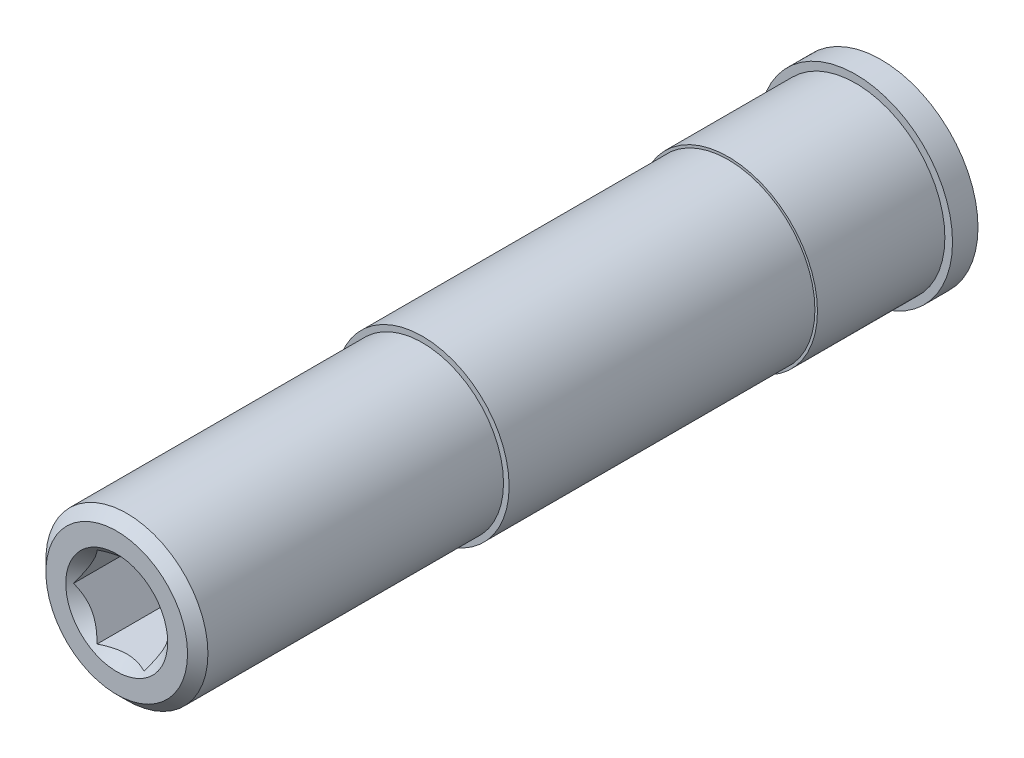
ISO-10303-21;
HEADER;
FILE_DESCRIPTION(('STEP AP214'),'2;1');
FILE_NAME('part.step','',(''),(''),'','','');
FILE_SCHEMA(('AUTOMOTIVE_DESIGN { 1 0 10303 214 1 1 1 1 }'));
ENDSEC;
DATA;
#1=APPLICATION_CONTEXT('core data for automotive mechanical design processes');
#2=APPLICATION_PROTOCOL_DEFINITION('international standard','automotive_design',2000,#1);
#3=PRODUCT_CONTEXT('',#1,'mechanical');
#4=PRODUCT('Part','Part','',(#3));
#5=PRODUCT_RELATED_PRODUCT_CATEGORY('part','',(#4));
#6=PRODUCT_DEFINITION_FORMATION('','',#4);
#7=PRODUCT_DEFINITION_CONTEXT('part definition',#1,'design');
#8=PRODUCT_DEFINITION('design','',#6,#7);
#9=PRODUCT_DEFINITION_SHAPE('','',#8);
#10=(LENGTH_UNIT() NAMED_UNIT(*) SI_UNIT(.MILLI.,.METRE.));
#11=(NAMED_UNIT(*) PLANE_ANGLE_UNIT() SI_UNIT($,.RADIAN.));
#12=(NAMED_UNIT(*) SI_UNIT($,.STERADIAN.) SOLID_ANGLE_UNIT());
#13=UNCERTAINTY_MEASURE_WITH_UNIT(LENGTH_MEASURE(1.E-05),#10,'distance_accuracy_value','');
#14=(GEOMETRIC_REPRESENTATION_CONTEXT(3) GLOBAL_UNCERTAINTY_ASSIGNED_CONTEXT((#13)) GLOBAL_UNIT_ASSIGNED_CONTEXT((#10,
#11,#12)) REPRESENTATION_CONTEXT('',''));
#15=CARTESIAN_POINT('',(0.,0.,0.));
#16=DIRECTION('',(0.,0.,1.));
#17=DIRECTION('',(1.,0.,0.));
#18=AXIS2_PLACEMENT_3D('',#15,#16,#17);
#19=CARTESIAN_POINT('',(0.,0.,45.));
#20=DIRECTION('',(0.,0.,1.));
#21=DIRECTION('',(1.,0.,0.));
#22=AXIS2_PLACEMENT_3D('',#19,#20,#21);
#23=PLANE('',#22);
#24=CARTESIAN_POINT('',(0.,0.,45.));
#25=DIRECTION('',(0.,0.,1.));
#26=DIRECTION('',(1.,0.,0.));
#27=AXIS2_PLACEMENT_3D('',#24,#25,#26);
#28=CIRCLE('',#27,8.5);
#29=CARTESIAN_POINT('',(8.5,0.,45.));
#30=VERTEX_POINT('',#29);
#31=EDGE_CURVE('E134',#30,#30,#28,.T.);
#32=ORIENTED_EDGE('',*,*,#31,.T.);
#33=EDGE_LOOP('',(#32));
#34=FACE_BOUND('',#33,.T.);
#35=CARTESIAN_POINT('',(0.,0.,45.));
#36=DIRECTION('',(0.,0.,1.));
#37=DIRECTION('',(1.,0.,0.));
#38=AXIS2_PLACEMENT_3D('',#35,#36,#37);
#39=CIRCLE('',#38,7.95);
#40=CARTESIAN_POINT('',(7.95,0.,45.));
#41=VERTEX_POINT('',#40);
#42=EDGE_CURVE('E120',#41,#41,#39,.T.);
#43=ORIENTED_EDGE('',*,*,#42,.F.);
#44=EDGE_LOOP('',(#43));
#45=FACE_BOUND('',#44,.T.);
#46=ADVANCED_FACE('F32',(#34,#45),#23,.T.);
#47=CARTESIAN_POINT('',(0.,0.,15.));
#48=DIRECTION('',(0.,0.,1.));
#49=DIRECTION('',(1.,0.,0.));
#50=AXIS2_PLACEMENT_3D('',#47,#48,#49);
#51=PLANE('',#50);
#52=CARTESIAN_POINT('',(0.,0.,15.));
#53=DIRECTION('',(0.,0.,1.));
#54=DIRECTION('',(1.,0.,0.));
#55=AXIS2_PLACEMENT_3D('',#52,#53,#54);
#56=CIRCLE('',#55,8.75);
#57=CARTESIAN_POINT('',(8.75,0.,15.));
#58=VERTEX_POINT('',#57);
#59=EDGE_CURVE('E140',#58,#58,#56,.T.);
#60=ORIENTED_EDGE('',*,*,#59,.T.);
#61=EDGE_LOOP('',(#60));
#62=FACE_BOUND('',#61,.T.);
#63=CARTESIAN_POINT('',(0.,0.,15.));
#64=DIRECTION('',(0.,0.,1.));
#65=DIRECTION('',(1.,0.,0.));
#66=AXIS2_PLACEMENT_3D('',#63,#64,#65);
#67=CIRCLE('',#66,8.5);
#68=CARTESIAN_POINT('',(8.5,0.,15.));
#69=VERTEX_POINT('',#68);
#70=EDGE_CURVE('E133',#69,#69,#67,.T.);
#71=ORIENTED_EDGE('',*,*,#70,.F.);
#72=EDGE_LOOP('',(#71));
#73=FACE_BOUND('',#72,.T.);
#74=ADVANCED_FACE('F213',(#62,#73),#51,.T.);
#75=CARTESIAN_POINT('',(0.,0.,2.5));
#76=DIRECTION('',(0.,0.,1.));
#77=DIRECTION('',(1.,0.,0.));
#78=AXIS2_PLACEMENT_3D('',#75,#76,#77);
#79=PLANE('',#78);
#80=CARTESIAN_POINT('',(0.,0.,2.5));
#81=DIRECTION('',(0.,0.,1.));
#82=DIRECTION('',(1.,0.,0.));
#83=AXIS2_PLACEMENT_3D('',#80,#81,#82);
#84=CIRCLE('',#83,9.5);
#85=CARTESIAN_POINT('',(9.5,0.,2.5));
#86=VERTEX_POINT('',#85);
#87=EDGE_CURVE('E146',#86,#86,#84,.T.);
#88=ORIENTED_EDGE('',*,*,#87,.T.);
#89=EDGE_LOOP('',(#88));
#90=FACE_BOUND('',#89,.T.);
#91=CARTESIAN_POINT('',(0.,0.,2.5));
#92=DIRECTION('',(0.,0.,1.));
#93=DIRECTION('',(1.,0.,0.));
#94=AXIS2_PLACEMENT_3D('',#91,#92,#93);
#95=CIRCLE('',#94,8.75);
#96=CARTESIAN_POINT('',(8.75,0.,2.5));
#97=VERTEX_POINT('',#96);
#98=EDGE_CURVE('E137',#97,#97,#95,.T.);
#99=ORIENTED_EDGE('',*,*,#98,.F.);
#100=EDGE_LOOP('',(#99));
#101=FACE_BOUND('',#100,.T.);
#102=ADVANCED_FACE('F219',(#90,#101),#79,.T.);
#103=CARTESIAN_POINT('',(0.,0.,2.5));
#104=DIRECTION('',(0.,0.,-1.));
#105=DIRECTION('',(-1.,0.,0.));
#106=AXIS2_PLACEMENT_3D('',#103,#104,#105);
#107=CYLINDRICAL_SURFACE('',#106,9.5);
#108=ORIENTED_EDGE('',*,*,#87,.F.);
#109=EDGE_LOOP('',(#108));
#110=FACE_BOUND('',#109,.T.);
#111=CARTESIAN_POINT('',(0.,0.,0.));
#112=DIRECTION('',(0.,0.,1.));
#113=DIRECTION('',(1.,0.,0.));
#114=AXIS2_PLACEMENT_3D('',#111,#112,#113);
#115=CIRCLE('',#114,9.5);
#116=CARTESIAN_POINT('',(9.5,0.,0.));
#117=VERTEX_POINT('',#116);
#118=EDGE_CURVE('E143',#117,#117,#115,.T.);
#119=ORIENTED_EDGE('',*,*,#118,.T.);
#120=EDGE_LOOP('',(#119));
#121=FACE_BOUND('',#120,.T.);
#122=ADVANCED_FACE('F236',(#110,#121),#107,.T.);
#123=CARTESIAN_POINT('',(0.,0.,0.));
#124=DIRECTION('',(0.,0.,1.));
#125=DIRECTION('',(1.,0.,0.));
#126=AXIS2_PLACEMENT_3D('',#123,#124,#125);
#127=PLANE('',#126);
#128=ORIENTED_EDGE('',*,*,#118,.F.);
#129=EDGE_LOOP('',(#128));
#130=FACE_BOUND('',#129,.T.);
#131=ADVANCED_FACE('F232',(#130),#127,.F.);
#132=CARTESIAN_POINT('',(0.,0.,15.));
#133=DIRECTION('',(0.,0.,-1.));
#134=DIRECTION('',(-1.,0.,0.));
#135=AXIS2_PLACEMENT_3D('',#132,#133,#134);
#136=CYLINDRICAL_SURFACE('',#135,8.75);
#137=ORIENTED_EDGE('',*,*,#59,.F.);
#138=EDGE_LOOP('',(#137));
#139=FACE_BOUND('',#138,.T.);
#140=ORIENTED_EDGE('',*,*,#98,.T.);
#141=EDGE_LOOP('',(#140));
#142=FACE_BOUND('',#141,.T.);
#143=ADVANCED_FACE('F227',(#139,#142),#136,.T.);
#144=CARTESIAN_POINT('',(0.,0.,45.));
#145=DIRECTION('',(0.,0.,-1.));
#146=DIRECTION('',(-1.,0.,0.));
#147=AXIS2_PLACEMENT_3D('',#144,#145,#146);
#148=CYLINDRICAL_SURFACE('',#147,8.5);
#149=ORIENTED_EDGE('',*,*,#31,.F.);
#150=EDGE_LOOP('',(#149));
#151=FACE_BOUND('',#150,.T.);
#152=ORIENTED_EDGE('',*,*,#70,.T.);
#153=EDGE_LOOP('',(#152));
#154=FACE_BOUND('',#153,.T.);
#155=ADVANCED_FACE('F225',(#151,#154),#148,.T.);
#156=CARTESIAN_POINT('',(0.,0.,75.));
#157=DIRECTION('',(0.,0.,-1.));
#158=DIRECTION('',(-1.,0.,0.));
#159=AXIS2_PLACEMENT_3D('',#156,#157,#158);
#160=CYLINDRICAL_SURFACE('',#159,7.95);
#161=CARTESIAN_POINT('',(0.,0.,74.));
#162=DIRECTION('',(0.,0.,1.));
#163=DIRECTION('',(1.,0.,0.));
#164=AXIS2_PLACEMENT_3D('',#161,#162,#163);
#165=CIRCLE('',#164,7.95);
#166=CARTESIAN_POINT('',(7.95,0.,74.));
#167=VERTEX_POINT('',#166);
#168=EDGE_CURVE('E154',#167,#167,#165,.F.);
#169=ORIENTED_EDGE('',*,*,#168,.T.);
#170=EDGE_LOOP('',(#169));
#171=FACE_BOUND('',#170,.T.);
#172=ORIENTED_EDGE('',*,*,#42,.T.);
#173=EDGE_LOOP('',(#172));
#174=FACE_BOUND('',#173,.T.);
#175=ADVANCED_FACE('F224',(#171,#174),#160,.T.);
#176=CARTESIAN_POINT('',(0.,0.,75.));
#177=DIRECTION('',(0.,0.,1.));
#178=DIRECTION('',(1.,0.,0.));
#179=AXIS2_PLACEMENT_3D('',#176,#177,#178);
#180=PLANE('',#179);
#181=CARTESIAN_POINT('',(0.,0.,75.));
#182=DIRECTION('',(0.,0.,1.));
#183=DIRECTION('',(1.,0.,0.));
#184=AXIS2_PLACEMENT_3D('',#181,#182,#183);
#185=CIRCLE('',#184,5.);
#186=CARTESIAN_POINT('',(5.,0.,75.));
#187=VERTEX_POINT('',#186);
#188=EDGE_CURVE('E157',#187,#187,#185,.F.);
#189=ORIENTED_EDGE('',*,*,#188,.T.);
#190=EDGE_LOOP('',(#189));
#191=FACE_BOUND('',#190,.T.);
#192=CARTESIAN_POINT('',(0.,0.,75.));
#193=DIRECTION('',(0.,0.,1.));
#194=DIRECTION('',(1.,0.,0.));
#195=AXIS2_PLACEMENT_3D('',#192,#193,#194);
#196=CIRCLE('',#195,6.95);
#197=CARTESIAN_POINT('',(6.95,0.,75.));
#198=VERTEX_POINT('',#197);
#199=EDGE_CURVE('E149',#198,#198,#196,.T.);
#200=ORIENTED_EDGE('',*,*,#199,.T.);
#201=EDGE_LOOP('',(#200));
#202=FACE_BOUND('',#201,.T.);
#203=ADVANCED_FACE('F182',(#191,#202),#180,.T.);
#204=CARTESIAN_POINT('',(0.,0.,75.));
#205=DIRECTION('',(0.,0.,-1.));
#206=DIRECTION('',(-1.,0.,0.));
#207=AXIS2_PLACEMENT_3D('',#204,#205,#206);
#208=CONICAL_SURFACE('',#207,6.95,0.785398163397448);
#209=ORIENTED_EDGE('',*,*,#168,.F.);
#210=EDGE_LOOP('',(#209));
#211=FACE_BOUND('',#210,.T.);
#212=ORIENTED_EDGE('',*,*,#199,.F.);
#213=EDGE_LOOP('',(#212));
#214=FACE_BOUND('',#213,.T.);
#215=ADVANCED_FACE('F243',(#211,#214),#208,.T.);
#216=CARTESIAN_POINT('',(0.,0.,74.));
#217=DIRECTION('',(0.,0.,1.));
#218=DIRECTION('',(1.,0.,0.));
#219=AXIS2_PLACEMENT_3D('',#216,#217,#218);
#220=CONICAL_SURFACE('',#219,4.,0.785398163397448);
#221=CARTESIAN_POINT('',(-4.61891762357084,0.000200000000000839,74.6189176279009));
#222=CARTESIAN_POINT('',(-4.57920690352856,-0.0685809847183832,74.5792110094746));
#223=CARTESIAN_POINT('',(-4.53919230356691,-0.137888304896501,74.5407225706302));
#224=CARTESIAN_POINT('',(-4.45849274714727,-0.277664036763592,74.4665533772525));
#225=CARTESIAN_POINT('',(-4.41780743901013,-0.348133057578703,74.4308741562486));
#226=CARTESIAN_POINT('',(-4.29427352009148,-0.562100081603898,74.328303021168));
#227=CARTESIAN_POINT('',(-4.21037499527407,-0.707416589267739,74.2663152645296));
#228=CARTESIAN_POINT('',(-4.04121970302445,-1.00040214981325,74.1601580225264));
#229=CARTESIAN_POINT('',(-3.95600566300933,-1.14799719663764,74.1157212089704));
#230=CARTESIAN_POINT('',(-3.78369592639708,-1.44644641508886,74.0472511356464));
#231=CARTESIAN_POINT('',(-3.6966055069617,-1.59729144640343,74.0231667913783));
#232=CARTESIAN_POINT('',(-3.54650860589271,-1.85726690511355,74.0014370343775));
#233=CARTESIAN_POINT('',(-3.48369550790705,-1.96606238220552,73.9982210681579));
#234=CARTESIAN_POINT('',(-3.35817126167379,-2.18347675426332,74.003642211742));
#235=CARTESIAN_POINT('',(-3.29546015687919,-2.29209557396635,74.0122834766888));
#236=CARTESIAN_POINT('',(-3.17063214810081,-2.50830402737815,74.0409261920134));
#237=CARTESIAN_POINT('',(-3.10851598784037,-2.61589237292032,74.0609403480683));
#238=CARTESIAN_POINT('',(-2.98535047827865,-2.82922129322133,74.1112363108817));
#239=CARTESIAN_POINT('',(-2.92430104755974,-2.93496200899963,74.1415173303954));
#240=CARTESIAN_POINT('',(-2.81592361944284,-3.12267722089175,74.2038174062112));
#241=CARTESIAN_POINT('',(-2.76835567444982,-3.2050673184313,74.2341984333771));
#242=CARTESIAN_POINT('',(-2.67407371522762,-3.36836846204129,74.2998566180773));
#243=CARTESIAN_POINT('',(-2.6273597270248,-3.44927946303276,74.3351339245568));
#244=CARTESIAN_POINT('',(-2.53493285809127,-3.60936749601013,74.4097938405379));
#245=CARTESIAN_POINT('',(-2.48921734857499,-3.68854908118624,74.4491635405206));
#246=CARTESIAN_POINT('',(-2.39863292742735,-3.84544590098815,74.5314912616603));
#247=CARTESIAN_POINT('',(-2.35376351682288,-3.92316199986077,74.574447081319));
#248=CARTESIAN_POINT('',(-2.30928560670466,-4.0002,74.6189176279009));
#249=B_SPLINE_CURVE_WITH_KNOTS('',3,(#221,#222,#223,#224,#225,#226,#227,#228,#229,#230,#231,
#232,#233,#234,#235,#236,#237,#238,#239,#240,#241,#242,#243,#244,#245,#246,#247,#248),
.UNSPECIFIED.,.F.,.F.,(4,2,2,2,2,2,2,2,2,2,2,2,2,4),(0.,0.266361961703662,0.532868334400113,
1.06875865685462,1.5961388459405,2.12219135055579,2.49866160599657,2.87526382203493,
3.25228760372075,3.62928248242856,3.9287494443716,4.22822551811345,4.52678401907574,
4.82516056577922),.UNSPECIFIED.);
#250=CARTESIAN_POINT('',(-4.618802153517,0.,74.618802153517));
#251=VERTEX_POINT('',#250);
#252=CARTESIAN_POINT('',(-2.3094010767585,-4.,74.618802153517));
#253=VERTEX_POINT('',#252);
#254=EDGE_CURVE('E11',#251,#253,#249,.T.);
#255=ORIENTED_EDGE('',*,*,#254,.F.);
#256=CARTESIAN_POINT('',(-2.30928560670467,4.0002,74.6189176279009));
#257=CARTESIAN_POINT('',(-2.34899632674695,3.93141901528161,74.5792110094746));
#258=CARTESIAN_POINT('',(-2.3890109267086,3.8621116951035,74.5407225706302));
#259=CARTESIAN_POINT('',(-2.46971048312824,3.7223359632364,74.4665533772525));
#260=CARTESIAN_POINT('',(-2.51039579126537,3.65186694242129,74.4308741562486));
#261=CARTESIAN_POINT('',(-2.63392971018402,3.4378999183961,74.328303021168));
#262=CARTESIAN_POINT('',(-2.71782823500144,3.29258341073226,74.2663152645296));
#263=CARTESIAN_POINT('',(-2.88698352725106,2.99959785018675,74.1601580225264));
#264=CARTESIAN_POINT('',(-2.97219756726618,2.85200280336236,74.1157212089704));
#265=CARTESIAN_POINT('',(-3.14450730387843,2.55355358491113,74.0472511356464));
#266=CARTESIAN_POINT('',(-3.23159772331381,2.40270855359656,74.0231667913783));
#267=CARTESIAN_POINT('',(-3.3816946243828,2.14273309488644,74.0014370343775));
#268=CARTESIAN_POINT('',(-3.44450772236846,2.03393761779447,73.9982210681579));
#269=CARTESIAN_POINT('',(-3.57003196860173,1.81652324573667,74.003642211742));
#270=CARTESIAN_POINT('',(-3.63274307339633,1.70790442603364,74.0122834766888));
#271=CARTESIAN_POINT('',(-3.7575710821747,1.49169597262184,74.0409261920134));
#272=CARTESIAN_POINT('',(-3.81968724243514,1.38410762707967,74.0609403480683));
#273=CARTESIAN_POINT('',(-3.94285275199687,1.17077870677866,74.1112363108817));
#274=CARTESIAN_POINT('',(-4.00390218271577,1.06503799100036,74.1415173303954));
#275=CARTESIAN_POINT('',(-4.11227961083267,0.877322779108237,74.2038174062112));
#276=CARTESIAN_POINT('',(-4.15984755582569,0.794932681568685,74.2341984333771));
#277=CARTESIAN_POINT('',(-4.25412951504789,0.631631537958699,74.2998566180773));
#278=CARTESIAN_POINT('',(-4.30084350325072,0.550720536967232,74.3351339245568));
#279=CARTESIAN_POINT('',(-4.39327037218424,0.390632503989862,74.4097938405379));
#280=CARTESIAN_POINT('',(-4.43898588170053,0.311450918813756,74.4491635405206));
#281=CARTESIAN_POINT('',(-4.52957030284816,0.154554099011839,74.5314912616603));
#282=CARTESIAN_POINT('',(-4.57443971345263,0.0768380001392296,74.574447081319));
#283=CARTESIAN_POINT('',(-4.61891762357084,-0.000200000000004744,74.6189176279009));
#284=B_SPLINE_CURVE_WITH_KNOTS('',3,(#256,#257,#258,#259,#260,#261,#262,#263,#264,#265,#266,
#267,#268,#269,#270,#271,#272,#273,#274,#275,#276,#277,#278,#279,#280,#281,#282,#283),
.UNSPECIFIED.,.F.,.F.,(4,2,2,2,2,2,2,2,2,2,2,2,2,4),(0.,0.266361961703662,0.532868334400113,
1.06875865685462,1.5961388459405,2.1221913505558,2.49866160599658,2.87526382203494,
3.25228760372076,3.62928248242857,3.92874944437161,4.22822551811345,4.52678401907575,
4.82516056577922),.UNSPECIFIED.);
#285=CARTESIAN_POINT('',(-2.3094010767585,4.,74.618802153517));
#286=VERTEX_POINT('',#285);
#287=EDGE_CURVE('E188',#286,#251,#284,.T.);
#288=ORIENTED_EDGE('',*,*,#287,.F.);
#289=CARTESIAN_POINT('',(-5.62739378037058,4.,76.9041698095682));
#290=CARTESIAN_POINT('',(-5.48567305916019,4.,76.7886867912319));
#291=CARTESIAN_POINT('',(-5.34325635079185,4.,76.6740442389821));
#292=CARTESIAN_POINT('',(-5.05668167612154,4.,76.4468822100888));
#293=CARTESIAN_POINT('',(-4.91252327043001,4.,76.3343632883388));
#294=CARTESIAN_POINT('',(-4.62060451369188,4.,76.1107371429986));
#295=CARTESIAN_POINT('',(-4.47282202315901,4.,75.9996587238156));
#296=CARTESIAN_POINT('',(-4.17478915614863,4.,75.780883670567));
#297=CARTESIAN_POINT('',(-4.02453901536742,4.,75.6731867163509));
#298=CARTESIAN_POINT('',(-3.70745510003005,4.,75.4526226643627));
#299=CARTESIAN_POINT('',(-3.54034108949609,4.,75.3401561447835));
#300=CARTESIAN_POINT('',(-3.20168901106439,4.,75.1219167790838));
#301=CARTESIAN_POINT('',(-3.03014957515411,4.,75.0161460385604));
#302=CARTESIAN_POINT('',(-2.68253937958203,4.,74.8141548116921));
#303=CARTESIAN_POINT('',(-2.50649297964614,4.,74.7178927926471));
#304=CARTESIAN_POINT('',(-2.14824323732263,4.,74.5377308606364));
#305=CARTESIAN_POINT('',(-1.9660452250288,4.,74.453820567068));
#306=CARTESIAN_POINT('',(-1.64622345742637,4.,74.3237785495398));
#307=CARTESIAN_POINT('',(-1.51024779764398,4.,74.2736228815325));
#308=CARTESIAN_POINT('',(-1.23468247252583,4.,74.1841925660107));
#309=CARTESIAN_POINT('',(-1.09509231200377,4.,74.1449194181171));
#310=CARTESIAN_POINT('',(-0.815895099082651,4.,74.0801558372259));
#311=CARTESIAN_POINT('',(-0.676354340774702,4.,74.0543844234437));
#312=CARTESIAN_POINT('',(-0.395369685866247,4.,74.0170833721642));
#313=CARTESIAN_POINT('',(-0.253926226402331,4.,74.0055505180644));
#314=CARTESIAN_POINT('',(0.0224344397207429,4.,73.9977950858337));
#315=CARTESIAN_POINT('',(0.157331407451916,4.,74.0008491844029));
#316=CARTESIAN_POINT('',(0.426139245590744,4.,74.0203999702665));
#317=CARTESIAN_POINT('',(0.560050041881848,4.,74.0368976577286));
#318=CARTESIAN_POINT('',(0.828249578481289,4.,74.0826693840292));
#319=CARTESIAN_POINT('',(0.962497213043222,4.,74.1121800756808));
#320=CARTESIAN_POINT('',(1.22800919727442,4.,74.1822950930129));
#321=CARTESIAN_POINT('',(1.35927363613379,4.,74.2228990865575));
#322=CARTESIAN_POINT('',(1.62314822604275,4.,74.3149472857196));
#323=CARTESIAN_POINT('',(1.75564045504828,4.,74.3667254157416));
#324=CARTESIAN_POINT('',(2.01721504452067,4.,74.4782979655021));
#325=CARTESIAN_POINT('',(2.14629632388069,4.,74.5380948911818));
#326=CARTESIAN_POINT('',(2.40167335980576,4.,74.6642976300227));
#327=CARTESIAN_POINT('',(2.52795890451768,4.,74.7307239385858));
#328=CARTESIAN_POINT('',(2.77764203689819,4.,74.8687240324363));
#329=CARTESIAN_POINT('',(2.90104005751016,4.,74.9402970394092));
#330=CARTESIAN_POINT('',(3.1392795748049,4.,75.0839454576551));
#331=CARTESIAN_POINT('',(3.25424234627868,4.,75.1558208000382));
#332=CARTESIAN_POINT('',(3.48219257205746,4.,75.3026473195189));
#333=CARTESIAN_POINT('',(3.59517987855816,4.,75.377598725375));
#334=CARTESIAN_POINT('',(3.81853437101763,4.,75.5294246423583));
#335=CARTESIAN_POINT('',(3.92891526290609,4.,75.6062790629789));
#336=CARTESIAN_POINT('',(4.14816043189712,4.,75.7620608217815));
#337=CARTESIAN_POINT('',(4.25702511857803,4.,75.8409875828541));
#338=CARTESIAN_POINT('',(4.3652532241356,4.,75.9207631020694));
#339=B_SPLINE_CURVE_WITH_KNOTS('',3,(#289,#290,#291,#292,#293,#294,#295,#296,#297,#298,#299,
#300,#301,#302,#303,#304,#305,#306,#307,#308,#309,#310,#311,#312,#313,#314,#315,#316,#317,#318,
#319,#320,#321,#322,#323,#324,#325,#326,#327,#328,#329,#330,#331,#332,#333,#334,#335,#336,#337,
#338),.UNSPECIFIED.,.F.,.F.,(4,2,2,2,2,2,2,2,2,2,2,2,2,2,2,2,2,2,2,2,2,2,2,2,4),(0.,
0.548452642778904,1.0970466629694,1.6516272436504,2.20615515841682,2.8103379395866,
3.41470978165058,4.01631281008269,4.61740731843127,5.05183569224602,5.48632390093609,
5.91136971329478,6.33631948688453,6.74042244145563,7.14455546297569,7.5563622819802,
7.9681567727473,8.39458384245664,8.82114448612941,9.24906733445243,9.67692560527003,
10.0836145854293,10.4903338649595,10.8938112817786,11.2971775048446),.UNSPECIFIED.);
#340=CARTESIAN_POINT('',(2.3094010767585,4.,74.618802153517));
#341=VERTEX_POINT('',#340);
#342=EDGE_CURVE('E166',#341,#286,#339,.F.);
#343=ORIENTED_EDGE('',*,*,#342,.F.);
#344=CARTESIAN_POINT('',(4.61891762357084,-0.000200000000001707,74.6189176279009));
#345=CARTESIAN_POINT('',(4.57920690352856,0.0685809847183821,74.5792110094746));
#346=CARTESIAN_POINT('',(4.53919230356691,0.1378883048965,74.5407225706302));
#347=CARTESIAN_POINT('',(4.45849274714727,0.277664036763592,74.4665533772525));
#348=CARTESIAN_POINT('',(4.41780743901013,0.348133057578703,74.4308741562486));
#349=CARTESIAN_POINT('',(4.29427352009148,0.562100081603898,74.328303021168));
#350=CARTESIAN_POINT('',(4.21037499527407,0.70741658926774,74.2663152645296));
#351=CARTESIAN_POINT('',(4.04121970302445,1.00040214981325,74.1601580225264));
#352=CARTESIAN_POINT('',(3.95600566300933,1.14799719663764,74.1157212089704));
#353=CARTESIAN_POINT('',(3.78369592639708,1.44644641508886,74.0472511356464));
#354=CARTESIAN_POINT('',(3.6966055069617,1.59729144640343,74.0231667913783));
#355=CARTESIAN_POINT('',(3.54650860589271,1.85726690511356,74.0014370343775));
#356=CARTESIAN_POINT('',(3.48369550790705,1.96606238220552,73.9982210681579));
#357=CARTESIAN_POINT('',(3.35817126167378,2.18347675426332,74.003642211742));
#358=CARTESIAN_POINT('',(3.29546015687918,2.29209557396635,74.0122834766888));
#359=CARTESIAN_POINT('',(3.17063214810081,2.50830402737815,74.0409261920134));
#360=CARTESIAN_POINT('',(3.10851598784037,2.61589237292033,74.0609403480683));
#361=CARTESIAN_POINT('',(2.98535047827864,2.82922129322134,74.1112363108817));
#362=CARTESIAN_POINT('',(2.92430104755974,2.93496200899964,74.1415173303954));
#363=CARTESIAN_POINT('',(2.81592361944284,3.12267722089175,74.2038174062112));
#364=CARTESIAN_POINT('',(2.76835567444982,3.2050673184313,74.2341984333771));
#365=CARTESIAN_POINT('',(2.67407371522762,3.36836846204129,74.2998566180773));
#366=CARTESIAN_POINT('',(2.62735972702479,3.44927946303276,74.3351339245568));
#367=CARTESIAN_POINT('',(2.53493285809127,3.60936749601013,74.4097938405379));
#368=CARTESIAN_POINT('',(2.48921734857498,3.68854908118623,74.4491635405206));
#369=CARTESIAN_POINT('',(2.39863292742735,3.84544590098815,74.5314912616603));
#370=CARTESIAN_POINT('',(2.35376351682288,3.92316199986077,74.574447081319));
#371=CARTESIAN_POINT('',(2.30928560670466,4.0002,74.6189176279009));
#372=B_SPLINE_CURVE_WITH_KNOTS('',3,(#344,#345,#346,#347,#348,#349,#350,#351,#352,#353,#354,
#355,#356,#357,#358,#359,#360,#361,#362,#363,#364,#365,#366,#367,#368,#369,#370,#371),
.UNSPECIFIED.,.F.,.F.,(4,2,2,2,2,2,2,2,2,2,2,2,2,4),(0.,0.266361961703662,0.532868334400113,
1.06875865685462,1.5961388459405,2.1221913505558,2.49866160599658,2.87526382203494,
3.25228760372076,3.62928248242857,3.9287494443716,4.22822551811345,4.52678401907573,
4.82516056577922),.UNSPECIFIED.);
#373=CARTESIAN_POINT('',(4.618802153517,0.,74.618802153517));
#374=VERTEX_POINT('',#373);
#375=EDGE_CURVE('E160',#374,#341,#372,.T.);
#376=ORIENTED_EDGE('',*,*,#375,.F.);
#377=CARTESIAN_POINT('',(2.30928560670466,-4.0002,74.6189176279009));
#378=CARTESIAN_POINT('',(2.34899632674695,-3.93141901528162,74.5792110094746));
#379=CARTESIAN_POINT('',(2.3890109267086,-3.8621116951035,74.5407225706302));
#380=CARTESIAN_POINT('',(2.46971048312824,-3.72233596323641,74.4665533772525));
#381=CARTESIAN_POINT('',(2.51039579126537,-3.6518669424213,74.4308741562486));
#382=CARTESIAN_POINT('',(2.63392971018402,-3.4378999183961,74.328303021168));
#383=CARTESIAN_POINT('',(2.71782823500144,-3.29258341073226,74.2663152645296));
#384=CARTESIAN_POINT('',(2.88698352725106,-2.99959785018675,74.1601580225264));
#385=CARTESIAN_POINT('',(2.97219756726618,-2.85200280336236,74.1157212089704));
#386=CARTESIAN_POINT('',(3.14450730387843,-2.55355358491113,74.0472511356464));
#387=CARTESIAN_POINT('',(3.23159772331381,-2.40270855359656,74.0231667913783));
#388=CARTESIAN_POINT('',(3.3816946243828,-2.14273309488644,74.0014370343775));
#389=CARTESIAN_POINT('',(3.44450772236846,-2.03393761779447,73.9982210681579));
#390=CARTESIAN_POINT('',(3.57003196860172,-1.81652324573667,74.003642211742));
#391=CARTESIAN_POINT('',(3.63274307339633,-1.70790442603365,74.0122834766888));
#392=CARTESIAN_POINT('',(3.7575710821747,-1.49169597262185,74.0409261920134));
#393=CARTESIAN_POINT('',(3.81968724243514,-1.38410762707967,74.0609403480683));
#394=CARTESIAN_POINT('',(3.94285275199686,-1.17077870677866,74.1112363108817));
#395=CARTESIAN_POINT('',(4.00390218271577,-1.06503799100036,74.1415173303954));
#396=CARTESIAN_POINT('',(4.11227961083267,-0.877322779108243,74.2038174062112));
#397=CARTESIAN_POINT('',(4.15984755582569,-0.794932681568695,74.2341984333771));
#398=CARTESIAN_POINT('',(4.25412951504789,-0.63163153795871,74.2998566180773));
#399=CARTESIAN_POINT('',(4.30084350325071,-0.550720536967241,74.3351339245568));
#400=CARTESIAN_POINT('',(4.39327037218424,-0.390632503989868,74.4097938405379));
#401=CARTESIAN_POINT('',(4.43898588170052,-0.311450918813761,74.4491635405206));
#402=CARTESIAN_POINT('',(4.52957030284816,-0.15455409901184,74.5314912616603));
#403=CARTESIAN_POINT('',(4.57443971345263,-0.0768380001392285,74.5744470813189));
#404=CARTESIAN_POINT('',(4.61891762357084,0.000200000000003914,74.6189176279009));
#405=B_SPLINE_CURVE_WITH_KNOTS('',3,(#377,#378,#379,#380,#381,#382,#383,#384,#385,#386,#387,
#388,#389,#390,#391,#392,#393,#394,#395,#396,#397,#398,#399,#400,#401,#402,#403,#404),
.UNSPECIFIED.,.F.,.F.,(4,2,2,2,2,2,2,2,2,2,2,2,2,4),(0.,0.266361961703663,0.532868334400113,
1.06875865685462,1.59613884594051,2.1221913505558,2.49866160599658,2.87526382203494,
3.25228760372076,3.62928248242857,3.9287494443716,4.22822551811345,4.52678401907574,
4.82516056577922),.UNSPECIFIED.);
#406=CARTESIAN_POINT('',(2.3094010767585,-4.,74.618802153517));
#407=VERTEX_POINT('',#406);
#408=EDGE_CURVE('E52',#407,#374,#405,.T.);
#409=ORIENTED_EDGE('',*,*,#408,.F.);
#410=CARTESIAN_POINT('',(-5.62739378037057,-4.,76.9041698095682));
#411=CARTESIAN_POINT('',(-5.48567305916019,-4.,76.7886867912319));
#412=CARTESIAN_POINT('',(-5.34325635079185,-4.,76.6740442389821));
#413=CARTESIAN_POINT('',(-5.05668167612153,-4.,76.4468822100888));
#414=CARTESIAN_POINT('',(-4.91252327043,-4.,76.3343632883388));
#415=CARTESIAN_POINT('',(-4.62060451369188,-4.,76.1107371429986));
#416=CARTESIAN_POINT('',(-4.47282202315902,-4.,75.9996587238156));
#417=CARTESIAN_POINT('',(-4.17478915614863,-4.,75.780883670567));
#418=CARTESIAN_POINT('',(-4.02453901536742,-4.,75.6731867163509));
#419=CARTESIAN_POINT('',(-3.70745510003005,-4.,75.4526226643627));
#420=CARTESIAN_POINT('',(-3.5403410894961,-4.,75.3401561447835));
#421=CARTESIAN_POINT('',(-3.2016890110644,-4.,75.1219167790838));
#422=CARTESIAN_POINT('',(-3.03014957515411,-4.,75.0161460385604));
#423=CARTESIAN_POINT('',(-2.68253937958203,-4.,74.8141548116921));
#424=CARTESIAN_POINT('',(-2.50649297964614,-4.,74.7178927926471));
#425=CARTESIAN_POINT('',(-2.14824323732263,-4.,74.5377308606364));
#426=CARTESIAN_POINT('',(-1.9660452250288,-4.,74.453820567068));
#427=CARTESIAN_POINT('',(-1.64622345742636,-4.,74.3237785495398));
#428=CARTESIAN_POINT('',(-1.51024779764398,-4.,74.2736228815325));
#429=CARTESIAN_POINT('',(-1.23468247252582,-4.,74.1841925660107));
#430=CARTESIAN_POINT('',(-1.09509231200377,-4.,74.1449194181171));
#431=CARTESIAN_POINT('',(-0.815895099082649,-4.,74.0801558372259));
#432=CARTESIAN_POINT('',(-0.676354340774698,-4.,74.0543844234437));
#433=CARTESIAN_POINT('',(-0.395369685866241,-4.,74.0170833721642));
#434=CARTESIAN_POINT('',(-0.253926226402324,-4.,74.0055505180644));
#435=CARTESIAN_POINT('',(0.0224344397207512,-4.,73.9977950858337));
#436=CARTESIAN_POINT('',(0.157331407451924,-4.,74.0008491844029));
#437=CARTESIAN_POINT('',(0.426139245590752,-4.,74.0203999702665));
#438=CARTESIAN_POINT('',(0.560050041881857,-4.,74.0368976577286));
#439=CARTESIAN_POINT('',(0.828249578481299,-4.,74.0826693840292));
#440=CARTESIAN_POINT('',(0.962497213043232,-4.,74.1121800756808));
#441=CARTESIAN_POINT('',(1.22800919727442,-4.,74.1822950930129));
#442=CARTESIAN_POINT('',(1.3592736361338,-4.,74.2228990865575));
#443=CARTESIAN_POINT('',(1.62314822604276,-4.,74.3149472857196));
#444=CARTESIAN_POINT('',(1.7556404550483,-4.,74.3667254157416));
#445=CARTESIAN_POINT('',(2.01721504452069,-4.,74.4782979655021));
#446=CARTESIAN_POINT('',(2.14629632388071,-4.,74.5380948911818));
#447=CARTESIAN_POINT('',(2.40167335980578,-4.,74.6642976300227));
#448=CARTESIAN_POINT('',(2.5279589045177,-4.,74.7307239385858));
#449=CARTESIAN_POINT('',(2.77764203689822,-4.,74.8687240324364));
#450=CARTESIAN_POINT('',(2.90104005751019,-4.,74.9402970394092));
#451=CARTESIAN_POINT('',(3.13927957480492,-4.,75.0839454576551));
#452=CARTESIAN_POINT('',(3.2542423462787,-4.,75.1558208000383));
#453=CARTESIAN_POINT('',(3.48219257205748,-4.,75.3026473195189));
#454=CARTESIAN_POINT('',(3.59517987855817,-4.,75.377598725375));
#455=CARTESIAN_POINT('',(3.81853437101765,-4.,75.5294246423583));
#456=CARTESIAN_POINT('',(3.9289152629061,-4.,75.6062790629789));
#457=CARTESIAN_POINT('',(4.14816043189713,-4.,75.7620608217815));
#458=CARTESIAN_POINT('',(4.25702511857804,-4.,75.8409875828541));
#459=CARTESIAN_POINT('',(4.36525322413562,-4.,75.9207631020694));
#460=B_SPLINE_CURVE_WITH_KNOTS('',3,(#410,#411,#412,#413,#414,#415,#416,#417,#418,#419,#420,
#421,#422,#423,#424,#425,#426,#427,#428,#429,#430,#431,#432,#433,#434,#435,#436,#437,#438,#439,
#440,#441,#442,#443,#444,#445,#446,#447,#448,#449,#450,#451,#452,#453,#454,#455,#456,#457,#458,
#459),.UNSPECIFIED.,.F.,.F.,(4,2,2,2,2,2,2,2,2,2,2,2,2,2,2,2,2,2,2,2,2,2,2,2,4),(0.,
0.548452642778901,1.09704666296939,1.65162724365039,2.20615515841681,2.81033793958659,
3.41470978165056,4.01631281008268,4.61740731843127,5.05183569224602,5.48632390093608,
5.91136971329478,6.33631948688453,6.74042244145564,7.1445554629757,7.55636228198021,
7.9681567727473,8.39458384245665,8.82114448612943,9.24906733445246,9.67692560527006,
10.0836145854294,10.4903338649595,10.8938112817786,11.2971775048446),.UNSPECIFIED.);
#461=EDGE_CURVE('E45',#253,#407,#460,.T.);
#462=ORIENTED_EDGE('',*,*,#461,.F.);
#463=EDGE_LOOP('',(#255,#288,#343,#376,#409,#462));
#464=FACE_BOUND('',#463,.T.);
#465=ORIENTED_EDGE('',*,*,#188,.F.);
#466=EDGE_LOOP('',(#465));
#467=FACE_BOUND('',#466,.T.);
#468=ADVANCED_FACE('F34',(#464,#467),#220,.F.);
#469=CARTESIAN_POINT('',(2.3094010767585,-4.,66.));
#470=DIRECTION('',(0.866025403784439,-0.5,0.));
#471=DIRECTION('',(0.5,0.866025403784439,0.));
#472=AXIS2_PLACEMENT_3D('',#469,#470,#471);
#473=PLANE('',#472);
#474=DIRECTION('',(0.,0.,1.));
#475=VECTOR('',#474,1.);
#476=CARTESIAN_POINT('',(2.3094010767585,-4.,66.));
#477=LINE('',#476,#475);
#478=CARTESIAN_POINT('',(2.3094010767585,-4.,66.));
#479=VERTEX_POINT('',#478);
#480=EDGE_CURVE('E118',#479,#407,#477,.T.);
#481=ORIENTED_EDGE('',*,*,#480,.T.);
#482=ORIENTED_EDGE('',*,*,#408,.T.);
#483=DIRECTION('',(0.,0.,1.));
#484=VECTOR('',#483,1.);
#485=CARTESIAN_POINT('',(4.618802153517,0.,66.));
#486=LINE('',#485,#484);
#487=CARTESIAN_POINT('',(4.618802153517,0.,66.));
#488=VERTEX_POINT('',#487);
#489=EDGE_CURVE('E86',#488,#374,#486,.T.);
#490=ORIENTED_EDGE('',*,*,#489,.F.);
#491=DIRECTION('',(0.5,0.866025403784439,0.));
#492=VECTOR('',#491,1.);
#493=CARTESIAN_POINT('',(2.3094010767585,-4.,66.));
#494=LINE('',#493,#492);
#495=EDGE_CURVE('E91',#479,#488,#494,.T.);
#496=ORIENTED_EDGE('',*,*,#495,.F.);
#497=EDGE_LOOP('',(#481,#482,#490,#496));
#498=FACE_BOUND('',#497,.T.);
#499=ADVANCED_FACE('F89',(#498),#473,.F.);
#500=CARTESIAN_POINT('',(-2.3094010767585,-4.,66.));
#501=DIRECTION('',(0.,-1.,0.));
#502=DIRECTION('',(0.,0.,-1.));
#503=AXIS2_PLACEMENT_3D('',#500,#501,#502);
#504=PLANE('',#503);
#505=DIRECTION('',(0.,0.,1.));
#506=VECTOR('',#505,1.);
#507=CARTESIAN_POINT('',(-2.3094010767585,-4.,66.));
#508=LINE('',#507,#506);
#509=CARTESIAN_POINT('',(-2.3094010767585,-4.,66.));
#510=VERTEX_POINT('',#509);
#511=EDGE_CURVE('E121',#510,#253,#508,.T.);
#512=ORIENTED_EDGE('',*,*,#511,.T.);
#513=ORIENTED_EDGE('',*,*,#461,.T.);
#514=ORIENTED_EDGE('',*,*,#480,.F.);
#515=DIRECTION('',(1.,0.,0.));
#516=VECTOR('',#515,1.);
#517=CARTESIAN_POINT('',(-2.3094010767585,-4.,66.));
#518=LINE('',#517,#516);
#519=EDGE_CURVE('E95',#510,#479,#518,.T.);
#520=ORIENTED_EDGE('',*,*,#519,.F.);
#521=EDGE_LOOP('',(#512,#513,#514,#520));
#522=FACE_BOUND('',#521,.T.);
#523=ADVANCED_FACE('F181',(#522),#504,.F.);
#524=CARTESIAN_POINT('',(-4.618802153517,0.,66.));
#525=DIRECTION('',(-0.866025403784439,-0.5,0.));
#526=DIRECTION('',(0.5,-0.866025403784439,0.));
#527=AXIS2_PLACEMENT_3D('',#524,#525,#526);
#528=PLANE('',#527);
#529=DIRECTION('',(0.,0.,1.));
#530=VECTOR('',#529,1.);
#531=CARTESIAN_POINT('',(-4.618802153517,0.,66.));
#532=LINE('',#531,#530);
#533=CARTESIAN_POINT('',(-4.618802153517,0.,66.));
#534=VERTEX_POINT('',#533);
#535=EDGE_CURVE('E124',#534,#251,#532,.T.);
#536=ORIENTED_EDGE('',*,*,#535,.T.);
#537=ORIENTED_EDGE('',*,*,#254,.T.);
#538=ORIENTED_EDGE('',*,*,#511,.F.);
#539=DIRECTION('',(0.5,-0.866025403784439,0.));
#540=VECTOR('',#539,1.);
#541=CARTESIAN_POINT('',(-4.618802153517,0.,66.));
#542=LINE('',#541,#540);
#543=EDGE_CURVE('E115',#534,#510,#542,.T.);
#544=ORIENTED_EDGE('',*,*,#543,.F.);
#545=EDGE_LOOP('',(#536,#537,#538,#544));
#546=FACE_BOUND('',#545,.T.);
#547=ADVANCED_FACE('F200',(#546),#528,.F.);
#548=CARTESIAN_POINT('',(-2.3094010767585,4.,66.));
#549=DIRECTION('',(-0.866025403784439,0.5,0.));
#550=DIRECTION('',(-0.5,-0.866025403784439,0.));
#551=AXIS2_PLACEMENT_3D('',#548,#549,#550);
#552=PLANE('',#551);
#553=ORIENTED_EDGE('',*,*,#287,.T.);
#554=ORIENTED_EDGE('',*,*,#535,.F.);
#555=DIRECTION('',(-0.5,-0.866025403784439,0.));
#556=VECTOR('',#555,1.);
#557=CARTESIAN_POINT('',(-2.3094010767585,4.,66.));
#558=LINE('',#557,#556);
#559=CARTESIAN_POINT('',(-2.3094010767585,4.,66.));
#560=VERTEX_POINT('',#559);
#561=EDGE_CURVE('E112',#560,#534,#558,.T.);
#562=ORIENTED_EDGE('',*,*,#561,.F.);
#563=DIRECTION('',(0.,0.,1.));
#564=VECTOR('',#563,1.);
#565=CARTESIAN_POINT('',(-2.3094010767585,4.,66.));
#566=LINE('',#565,#564);
#567=EDGE_CURVE('E127',#560,#286,#566,.T.);
#568=ORIENTED_EDGE('',*,*,#567,.T.);
#569=EDGE_LOOP('',(#553,#554,#562,#568));
#570=FACE_BOUND('',#569,.T.);
#571=ADVANCED_FACE('F197',(#570),#552,.F.);
#572=CARTESIAN_POINT('',(2.3094010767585,4.,66.));
#573=DIRECTION('',(0.,1.,0.));
#574=DIRECTION('',(-1.,0.,0.));
#575=AXIS2_PLACEMENT_3D('',#572,#573,#574);
#576=PLANE('',#575);
#577=ORIENTED_EDGE('',*,*,#342,.T.);
#578=ORIENTED_EDGE('',*,*,#567,.F.);
#579=DIRECTION('',(-1.,0.,0.));
#580=VECTOR('',#579,1.);
#581=CARTESIAN_POINT('',(2.3094010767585,4.,66.));
#582=LINE('',#581,#580);
#583=CARTESIAN_POINT('',(2.3094010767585,4.,66.));
#584=VERTEX_POINT('',#583);
#585=EDGE_CURVE('E104',#584,#560,#582,.T.);
#586=ORIENTED_EDGE('',*,*,#585,.F.);
#587=DIRECTION('',(0.,0.,1.));
#588=VECTOR('',#587,1.);
#589=CARTESIAN_POINT('',(2.3094010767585,4.,66.));
#590=LINE('',#589,#588);
#591=EDGE_CURVE('E94',#584,#341,#590,.T.);
#592=ORIENTED_EDGE('',*,*,#591,.T.);
#593=EDGE_LOOP('',(#577,#578,#586,#592));
#594=FACE_BOUND('',#593,.T.);
#595=ADVANCED_FACE('F175',(#594),#576,.F.);
#596=CARTESIAN_POINT('',(4.618802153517,0.,66.));
#597=DIRECTION('',(0.866025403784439,0.5,0.));
#598=DIRECTION('',(-0.5,0.866025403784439,0.));
#599=AXIS2_PLACEMENT_3D('',#596,#597,#598);
#600=PLANE('',#599);
#601=ORIENTED_EDGE('',*,*,#489,.T.);
#602=ORIENTED_EDGE('',*,*,#375,.T.);
#603=ORIENTED_EDGE('',*,*,#591,.F.);
#604=DIRECTION('',(-0.5,0.866025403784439,0.));
#605=VECTOR('',#604,1.);
#606=CARTESIAN_POINT('',(4.618802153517,0.,66.));
#607=LINE('',#606,#605);
#608=EDGE_CURVE('E98',#488,#584,#607,.T.);
#609=ORIENTED_EDGE('',*,*,#608,.F.);
#610=EDGE_LOOP('',(#601,#602,#603,#609));
#611=FACE_BOUND('',#610,.T.);
#612=ADVANCED_FACE('F99',(#611),#600,.F.);
#613=CARTESIAN_POINT('',(2.3094010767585,-4.,66.));
#614=DIRECTION('',(0.,0.,-1.));
#615=DIRECTION('',(-1.,0.,0.));
#616=AXIS2_PLACEMENT_3D('',#613,#614,#615);
#617=PLANE('',#616);
#618=ORIENTED_EDGE('',*,*,#495,.T.);
#619=ORIENTED_EDGE('',*,*,#608,.T.);
#620=ORIENTED_EDGE('',*,*,#585,.T.);
#621=ORIENTED_EDGE('',*,*,#561,.T.);
#622=ORIENTED_EDGE('',*,*,#543,.T.);
#623=ORIENTED_EDGE('',*,*,#519,.T.);
#624=EDGE_LOOP('',(#618,#619,#620,#621,#622,#623));
#625=FACE_BOUND('',#624,.T.);
#626=ADVANCED_FACE('F106',(#625),#617,.F.);
#627=CLOSED_SHELL('',(#46,#74,#102,#122,#131,#143,#155,#175,#203,#215,#468,#499,#523,#547,#571,
#595,#612,#626));
#628=MANIFOLD_SOLID_BREP('B2',#627);
#629=ADVANCED_BREP_SHAPE_REPRESENTATION('',(#18,#628),#14);
#630=SHAPE_DEFINITION_REPRESENTATION(#9,#629);
ENDSEC;
END-ISO-10303-21;
